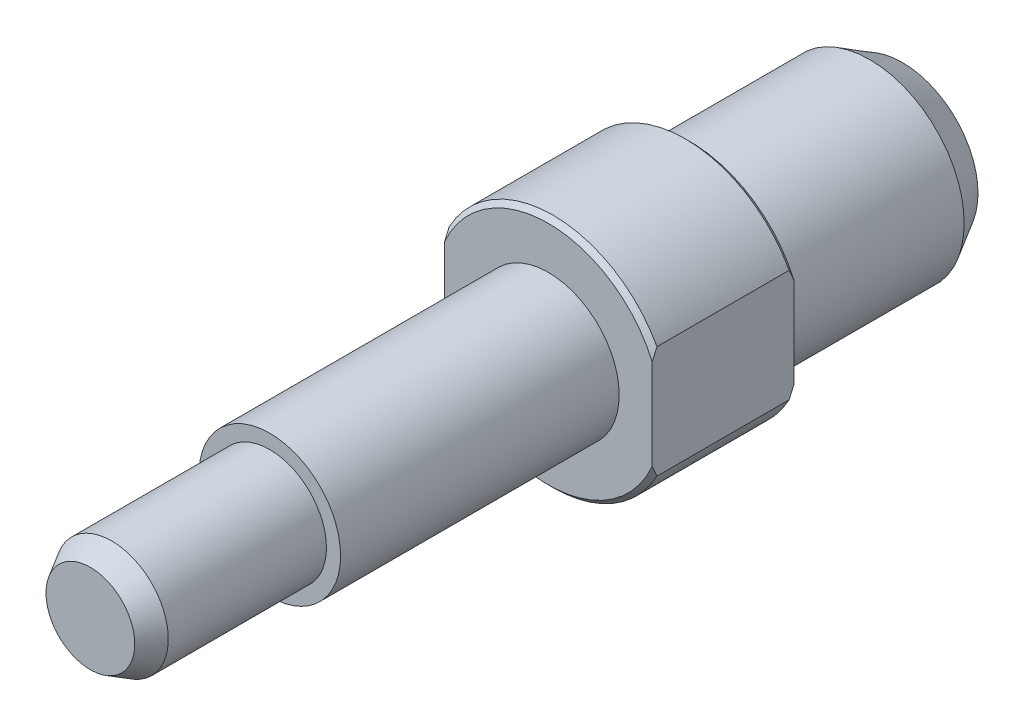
ISO-10303-21;
HEADER;
FILE_DESCRIPTION(('STEP AP214'),'2;1');
FILE_NAME('part.step','',(''),(''),'','','');
FILE_SCHEMA(('AUTOMOTIVE_DESIGN { 1 0 10303 214 1 1 1 1 }'));
ENDSEC;
DATA;
#1=APPLICATION_CONTEXT('core data for automotive mechanical design processes');
#2=APPLICATION_PROTOCOL_DEFINITION('international standard','automotive_design',2000,#1);
#3=PRODUCT_CONTEXT('',#1,'mechanical');
#4=PRODUCT('Part','Part','',(#3));
#5=PRODUCT_RELATED_PRODUCT_CATEGORY('part','',(#4));
#6=PRODUCT_DEFINITION_FORMATION('','',#4);
#7=PRODUCT_DEFINITION_CONTEXT('part definition',#1,'design');
#8=PRODUCT_DEFINITION('design','',#6,#7);
#9=PRODUCT_DEFINITION_SHAPE('','',#8);
#10=(LENGTH_UNIT() NAMED_UNIT(*) SI_UNIT(.MILLI.,.METRE.));
#11=(NAMED_UNIT(*) PLANE_ANGLE_UNIT() SI_UNIT($,.RADIAN.));
#12=(NAMED_UNIT(*) SI_UNIT($,.STERADIAN.) SOLID_ANGLE_UNIT());
#13=UNCERTAINTY_MEASURE_WITH_UNIT(LENGTH_MEASURE(1.E-05),#10,'distance_accuracy_value','');
#14=(GEOMETRIC_REPRESENTATION_CONTEXT(3) GLOBAL_UNCERTAINTY_ASSIGNED_CONTEXT((#13)) GLOBAL_UNIT_ASSIGNED_CONTEXT((#10,
#11,#12)) REPRESENTATION_CONTEXT('',''));
#15=CARTESIAN_POINT('',(0.,0.,0.));
#16=DIRECTION('',(0.,0.,1.));
#17=DIRECTION('',(1.,0.,0.));
#18=AXIS2_PLACEMENT_3D('',#15,#16,#17);
#19=CARTESIAN_POINT('',(0.,0.,0.));
#20=DIRECTION('',(0.,0.,1.));
#21=DIRECTION('',(1.,0.,0.));
#22=AXIS2_PLACEMENT_3D('',#19,#20,#21);
#23=PLANE('',#22);
#24=CARTESIAN_POINT('',(0.,0.,0.));
#25=DIRECTION('',(0.,0.,1.));
#26=DIRECTION('',(1.,0.,0.));
#27=AXIS2_PLACEMENT_3D('',#24,#25,#26);
#28=CIRCLE('',#27,10.);
#29=CARTESIAN_POINT('',(10.,0.,0.));
#30=VERTEX_POINT('',#29);
#31=EDGE_CURVE('E221',#30,#30,#28,.T.);
#32=ORIENTED_EDGE('',*,*,#31,.T.);
#33=EDGE_LOOP('',(#32));
#34=FACE_BOUND('',#33,.T.);
#35=DIRECTION('',(0.,-1.,0.));
#36=VECTOR('',#35,1.);
#37=CARTESIAN_POINT('',(11.,0.,0.));
#38=LINE('',#37,#36);
#39=CARTESIAN_POINT('',(11.,4.7958315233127,0.));
#40=VERTEX_POINT('',#39);
#41=CARTESIAN_POINT('',(11.,-4.7958315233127,0.));
#42=VERTEX_POINT('',#41);
#43=EDGE_CURVE('E212',#40,#42,#38,.T.);
#44=ORIENTED_EDGE('',*,*,#43,.T.);
#45=CARTESIAN_POINT('',(0.,0.,0.));
#46=DIRECTION('',(0.,0.,1.));
#47=DIRECTION('',(1.,0.,0.));
#48=AXIS2_PLACEMENT_3D('',#45,#46,#47);
#49=CIRCLE('',#48,12.);
#50=CARTESIAN_POINT('',(-11.,-4.7958315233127,0.));
#51=VERTEX_POINT('',#50);
#52=EDGE_CURVE('E398',#42,#51,#49,.F.);
#53=ORIENTED_EDGE('',*,*,#52,.T.);
#54=DIRECTION('',(0.,-1.,0.));
#55=VECTOR('',#54,1.);
#56=CARTESIAN_POINT('',(-11.,0.,0.));
#57=LINE('',#56,#55);
#58=CARTESIAN_POINT('',(-11.,4.7958315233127,0.));
#59=VERTEX_POINT('',#58);
#60=EDGE_CURVE('E87',#59,#51,#57,.T.);
#61=ORIENTED_EDGE('',*,*,#60,.F.);
#62=CARTESIAN_POINT('',(0.,0.,0.));
#63=DIRECTION('',(0.,0.,1.));
#64=DIRECTION('',(1.,0.,0.));
#65=AXIS2_PLACEMENT_3D('',#62,#63,#64);
#66=CIRCLE('',#65,12.);
#67=EDGE_CURVE('E397',#59,#40,#66,.F.);
#68=ORIENTED_EDGE('',*,*,#67,.T.);
#69=EDGE_LOOP('',(#44,#53,#61,#68));
#70=FACE_BOUND('',#69,.T.);
#71=ADVANCED_FACE('F14',(#34,#70),#23,.F.);
#72=CARTESIAN_POINT('',(0.,0.,15.));
#73=DIRECTION('',(0.,0.,-1.));
#74=DIRECTION('',(-1.,0.,0.));
#75=AXIS2_PLACEMENT_3D('',#72,#73,#74);
#76=CYLINDRICAL_SURFACE('',#75,12.5);
#77=DIRECTION('',(0.,0.,1.));
#78=VECTOR('',#77,1.);
#79=CARTESIAN_POINT('',(11.,5.93717104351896,-22.5));
#80=LINE('',#79,#78);
#81=CARTESIAN_POINT('',(11.,5.93717104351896,0.500000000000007));
#82=VERTEX_POINT('',#81);
#83=CARTESIAN_POINT('',(11.,5.93717104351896,14.5));
#84=VERTEX_POINT('',#83);
#85=EDGE_CURVE('E186',#82,#84,#80,.T.);
#86=ORIENTED_EDGE('',*,*,#85,.F.);
#87=CARTESIAN_POINT('',(0.,0.,0.500000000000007));
#88=DIRECTION('',(0.,0.,1.));
#89=DIRECTION('',(1.,0.,0.));
#90=AXIS2_PLACEMENT_3D('',#87,#88,#89);
#91=CIRCLE('',#90,12.5);
#92=CARTESIAN_POINT('',(-11.,5.93717104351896,0.500000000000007));
#93=VERTEX_POINT('',#92);
#94=EDGE_CURVE('E9',#82,#93,#91,.T.);
#95=ORIENTED_EDGE('',*,*,#94,.T.);
#96=DIRECTION('',(0.,0.,1.));
#97=VECTOR('',#96,1.);
#98=CARTESIAN_POINT('',(-11.,5.93717104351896,-22.5));
#99=LINE('',#98,#97);
#100=CARTESIAN_POINT('',(-11.,5.93717104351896,14.5));
#101=VERTEX_POINT('',#100);
#102=EDGE_CURVE('E102',#93,#101,#99,.T.);
#103=ORIENTED_EDGE('',*,*,#102,.T.);
#104=CARTESIAN_POINT('',(0.,0.,14.5));
#105=DIRECTION('',(0.,0.,1.));
#106=DIRECTION('',(1.,0.,0.));
#107=AXIS2_PLACEMENT_3D('',#104,#105,#106);
#108=CIRCLE('',#107,12.5);
#109=EDGE_CURVE('E23',#101,#84,#108,.F.);
#110=ORIENTED_EDGE('',*,*,#109,.T.);
#111=EDGE_LOOP('',(#86,#95,#103,#110));
#112=FACE_BOUND('',#111,.T.);
#113=ADVANCED_FACE('F185',(#112),#76,.T.);
#114=DIRECTION('',(0.,0.,1.));
#115=VECTOR('',#114,1.);
#116=CARTESIAN_POINT('',(-11.,-5.93717104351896,-22.5));
#117=LINE('',#116,#115);
#118=CARTESIAN_POINT('',(-11.,-5.93717104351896,0.500000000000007));
#119=VERTEX_POINT('',#118);
#120=CARTESIAN_POINT('',(-11.,-5.93717104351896,14.5));
#121=VERTEX_POINT('',#120);
#122=EDGE_CURVE('E84',#119,#121,#117,.T.);
#123=ORIENTED_EDGE('',*,*,#122,.F.);
#124=CARTESIAN_POINT('',(0.,0.,0.500000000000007));
#125=DIRECTION('',(0.,0.,1.));
#126=DIRECTION('',(1.,0.,0.));
#127=AXIS2_PLACEMENT_3D('',#124,#125,#126);
#128=CIRCLE('',#127,12.5);
#129=CARTESIAN_POINT('',(11.,-5.93717104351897,0.500000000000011));
#130=VERTEX_POINT('',#129);
#131=EDGE_CURVE('E98',#119,#130,#128,.T.);
#132=ORIENTED_EDGE('',*,*,#131,.T.);
#133=DIRECTION('',(0.,0.,1.));
#134=VECTOR('',#133,1.);
#135=CARTESIAN_POINT('',(11.,-5.93717104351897,-22.5));
#136=LINE('',#135,#134);
#137=CARTESIAN_POINT('',(11.,-5.93717104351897,14.5));
#138=VERTEX_POINT('',#137);
#139=EDGE_CURVE('E193',#130,#138,#136,.T.);
#140=ORIENTED_EDGE('',*,*,#139,.T.);
#141=CARTESIAN_POINT('',(0.,0.,14.5));
#142=DIRECTION('',(0.,0.,1.));
#143=DIRECTION('',(1.,0.,0.));
#144=AXIS2_PLACEMENT_3D('',#141,#142,#143);
#145=CIRCLE('',#144,12.5);
#146=EDGE_CURVE('E101',#138,#121,#145,.F.);
#147=ORIENTED_EDGE('',*,*,#146,.T.);
#148=EDGE_LOOP('',(#123,#132,#140,#147));
#149=FACE_BOUND('',#148,.T.);
#150=ADVANCED_FACE('F96',(#149),#76,.T.);
#151=CARTESIAN_POINT('',(0.,0.,15.));
#152=DIRECTION('',(0.,0.,1.));
#153=DIRECTION('',(1.,0.,0.));
#154=AXIS2_PLACEMENT_3D('',#151,#152,#153);
#155=PLANE('',#154);
#156=CARTESIAN_POINT('',(0.,0.,15.));
#157=DIRECTION('',(0.,0.,1.));
#158=DIRECTION('',(1.,0.,0.));
#159=AXIS2_PLACEMENT_3D('',#156,#157,#158);
#160=CIRCLE('',#159,7.5);
#161=CARTESIAN_POINT('',(7.5,0.,15.));
#162=VERTEX_POINT('',#161);
#163=EDGE_CURVE('E218',#162,#162,#160,.T.);
#164=ORIENTED_EDGE('',*,*,#163,.F.);
#165=EDGE_LOOP('',(#164));
#166=FACE_BOUND('',#165,.T.);
#167=DIRECTION('',(0.,-1.,0.));
#168=VECTOR('',#167,1.);
#169=CARTESIAN_POINT('',(-11.,5.93717104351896,15.));
#170=LINE('',#169,#168);
#171=CARTESIAN_POINT('',(-11.,4.79583152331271,15.));
#172=VERTEX_POINT('',#171);
#173=CARTESIAN_POINT('',(-11.,-4.79583152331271,15.));
#174=VERTEX_POINT('',#173);
#175=EDGE_CURVE('E103',#172,#174,#170,.T.);
#176=ORIENTED_EDGE('',*,*,#175,.T.);
#177=CARTESIAN_POINT('',(0.,0.,15.));
#178=DIRECTION('',(0.,0.,1.));
#179=DIRECTION('',(1.,0.,0.));
#180=AXIS2_PLACEMENT_3D('',#177,#178,#179);
#181=CIRCLE('',#180,12.);
#182=CARTESIAN_POINT('',(11.,-4.79583152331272,15.));
#183=VERTEX_POINT('',#182);
#184=EDGE_CURVE('E179',#174,#183,#181,.T.);
#185=ORIENTED_EDGE('',*,*,#184,.T.);
#186=DIRECTION('',(0.,-1.,0.));
#187=VECTOR('',#186,1.);
#188=CARTESIAN_POINT('',(11.,5.93717104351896,15.));
#189=LINE('',#188,#187);
#190=CARTESIAN_POINT('',(11.,4.79583152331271,15.));
#191=VERTEX_POINT('',#190);
#192=EDGE_CURVE('E194',#191,#183,#189,.T.);
#193=ORIENTED_EDGE('',*,*,#192,.F.);
#194=CARTESIAN_POINT('',(0.,0.,15.));
#195=DIRECTION('',(0.,0.,1.));
#196=DIRECTION('',(1.,0.,0.));
#197=AXIS2_PLACEMENT_3D('',#194,#195,#196);
#198=CIRCLE('',#197,12.);
#199=EDGE_CURVE('E91',#191,#172,#198,.T.);
#200=ORIENTED_EDGE('',*,*,#199,.T.);
#201=EDGE_LOOP('',(#176,#185,#193,#200));
#202=FACE_BOUND('',#201,.T.);
#203=ADVANCED_FACE('F199',(#166,#202),#155,.T.);
#204=CARTESIAN_POINT('',(0.,0.,0.));
#205=DIRECTION('',(0.,0.,-1.));
#206=DIRECTION('',(-1.,0.,0.));
#207=AXIS2_PLACEMENT_3D('',#204,#205,#206);
#208=CYLINDRICAL_SURFACE('',#207,10.);
#209=CARTESIAN_POINT('',(0.,0.,-19.0358983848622));
#210=DIRECTION('',(0.,0.,1.));
#211=DIRECTION('',(1.,0.,0.));
#212=AXIS2_PLACEMENT_3D('',#209,#210,#211);
#213=CIRCLE('',#212,10.);
#214=CARTESIAN_POINT('',(10.,0.,-19.0358983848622));
#215=VERTEX_POINT('',#214);
#216=EDGE_CURVE('E201',#215,#215,#213,.T.);
#217=ORIENTED_EDGE('',*,*,#216,.T.);
#218=EDGE_LOOP('',(#217));
#219=FACE_BOUND('',#218,.T.);
#220=ORIENTED_EDGE('',*,*,#31,.F.);
#221=EDGE_LOOP('',(#220));
#222=FACE_BOUND('',#221,.T.);
#223=ADVANCED_FACE('F228',(#219,#222),#208,.T.);
#224=CARTESIAN_POINT('',(0.,0.,44.5));
#225=DIRECTION('',(0.,0.,-1.));
#226=DIRECTION('',(-1.,0.,0.));
#227=AXIS2_PLACEMENT_3D('',#224,#225,#226);
#228=CYLINDRICAL_SURFACE('',#227,7.5);
#229=CARTESIAN_POINT('',(0.,0.,44.5));
#230=DIRECTION('',(0.,0.,1.));
#231=DIRECTION('',(1.,0.,0.));
#232=AXIS2_PLACEMENT_3D('',#229,#230,#231);
#233=CIRCLE('',#232,7.5);
#234=CARTESIAN_POINT('',(7.5,0.,44.5));
#235=VERTEX_POINT('',#234);
#236=EDGE_CURVE('E215',#235,#235,#233,.T.);
#237=ORIENTED_EDGE('',*,*,#236,.F.);
#238=EDGE_LOOP('',(#237));
#239=FACE_BOUND('',#238,.T.);
#240=ORIENTED_EDGE('',*,*,#163,.T.);
#241=EDGE_LOOP('',(#240));
#242=FACE_BOUND('',#241,.T.);
#243=ADVANCED_FACE('F230',(#239,#242),#228,.T.);
#244=CARTESIAN_POINT('',(0.,0.,44.5));
#245=DIRECTION('',(0.,0.,1.));
#246=DIRECTION('',(1.,0.,0.));
#247=AXIS2_PLACEMENT_3D('',#244,#245,#246);
#248=PLANE('',#247);
#249=CARTESIAN_POINT('',(0.,0.,44.5));
#250=DIRECTION('',(0.,0.,1.));
#251=DIRECTION('',(1.,0.,0.));
#252=AXIS2_PLACEMENT_3D('',#249,#250,#251);
#253=CIRCLE('',#252,6.);
#254=CARTESIAN_POINT('',(6.,0.,44.5));
#255=VERTEX_POINT('',#254);
#256=EDGE_CURVE('E111',#255,#255,#253,.T.);
#257=ORIENTED_EDGE('',*,*,#256,.F.);
#258=EDGE_LOOP('',(#257));
#259=FACE_BOUND('',#258,.T.);
#260=ORIENTED_EDGE('',*,*,#236,.T.);
#261=EDGE_LOOP('',(#260));
#262=FACE_BOUND('',#261,.T.);
#263=ADVANCED_FACE('F232',(#259,#262),#248,.T.);
#264=CARTESIAN_POINT('',(0.,0.,63.5));
#265=DIRECTION('',(0.,0.,-1.));
#266=DIRECTION('',(-1.,0.,0.));
#267=AXIS2_PLACEMENT_3D('',#264,#265,#266);
#268=CYLINDRICAL_SURFACE('',#267,6.);
#269=CARTESIAN_POINT('',(0.,0.,61.2483339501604));
#270=DIRECTION('',(0.,0.,-1.));
#271=DIRECTION('',(-1.,0.,0.));
#272=AXIS2_PLACEMENT_3D('',#269,#270,#271);
#273=CIRCLE('',#272,6.);
#274=CARTESIAN_POINT('',(-6.,0.,61.2483339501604));
#275=VERTEX_POINT('',#274);
#276=EDGE_CURVE('E269',#275,#275,#273,.T.);
#277=ORIENTED_EDGE('',*,*,#276,.T.);
#278=EDGE_LOOP('',(#277));
#279=FACE_BOUND('',#278,.T.);
#280=ORIENTED_EDGE('',*,*,#256,.T.);
#281=EDGE_LOOP('',(#280));
#282=FACE_BOUND('',#281,.T.);
#283=ADVANCED_FACE('F130',(#279,#282),#268,.T.);
#284=CARTESIAN_POINT('',(11.,5.93717104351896,-22.5));
#285=DIRECTION('',(-1.,0.,0.));
#286=DIRECTION('',(0.,-1.,0.));
#287=AXIS2_PLACEMENT_3D('',#284,#285,#286);
#288=PLANE('',#287);
#289=ORIENTED_EDGE('',*,*,#139,.F.);
#290=CARTESIAN_POINT('',(11.,-5.93717104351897,0.500000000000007));
#291=CARTESIAN_POINT('',(11.,-5.84334950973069,0.455437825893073));
#292=CARTESIAN_POINT('',(11.,-5.74921029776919,0.41154159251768));
#293=CARTESIAN_POINT('',(11.,-5.56030813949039,0.325176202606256));
#294=CARTESIAN_POINT('',(11.,-5.4655453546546,0.282706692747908));
#295=CARTESIAN_POINT('',(11.,-5.27535928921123,0.199266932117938));
#296=CARTESIAN_POINT('',(11.,-5.17993599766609,0.158296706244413));
#297=CARTESIAN_POINT('',(11.,-4.98839837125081,0.077936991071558));
#298=CARTESIAN_POINT('',(11.,-4.89228386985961,0.0385478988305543));
#299=CARTESIAN_POINT('',(11.,-4.7958315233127,0.));
#300=B_SPLINE_CURVE_WITH_KNOTS('',3,(#290,#291,#292,#293,#294,#295,#296,#297,#298,#299),
.UNSPECIFIED.,.F.,.F.,(4,2,2,2,4),(0.,0.311598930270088,0.623120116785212,0.934646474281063,
1.24625057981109),.UNSPECIFIED.);
#301=EDGE_CURVE('E106',#130,#42,#300,.T.);
#302=ORIENTED_EDGE('',*,*,#301,.T.);
#303=ORIENTED_EDGE('',*,*,#43,.F.);
#304=CARTESIAN_POINT('',(11.,4.7958315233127,0.));
#305=CARTESIAN_POINT('',(11.,4.89228386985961,0.0385478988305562));
#306=CARTESIAN_POINT('',(11.,4.9883983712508,0.0779369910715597));
#307=CARTESIAN_POINT('',(11.,5.17993599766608,0.158296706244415));
#308=CARTESIAN_POINT('',(11.,5.27535928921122,0.19926693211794));
#309=CARTESIAN_POINT('',(11.,5.4655453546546,0.282706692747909));
#310=CARTESIAN_POINT('',(11.,5.56030813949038,0.325176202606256));
#311=CARTESIAN_POINT('',(11.,5.74921029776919,0.411541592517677));
#312=CARTESIAN_POINT('',(11.,5.84334950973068,0.455437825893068));
#313=CARTESIAN_POINT('',(11.,5.93717104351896,0.5));
#314=B_SPLINE_CURVE_WITH_KNOTS('',3,(#304,#305,#306,#307,#308,#309,#310,#311,#312,#313),
.UNSPECIFIED.,.F.,.F.,(4,2,2,2,4),(0.,0.31160410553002,0.623130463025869,0.93465164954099,
1.24625057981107),.UNSPECIFIED.);
#315=EDGE_CURVE('E109',#40,#82,#314,.T.);
#316=ORIENTED_EDGE('',*,*,#315,.T.);
#317=ORIENTED_EDGE('',*,*,#85,.T.);
#318=CARTESIAN_POINT('',(11.,5.93717104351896,14.5));
#319=CARTESIAN_POINT('',(11.,5.84334950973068,14.5445621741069));
#320=CARTESIAN_POINT('',(11.,5.74921029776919,14.5884584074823));
#321=CARTESIAN_POINT('',(11.,5.56030813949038,14.6748237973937));
#322=CARTESIAN_POINT('',(11.,5.4655453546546,14.7172933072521));
#323=CARTESIAN_POINT('',(11.,5.27535928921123,14.8007330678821));
#324=CARTESIAN_POINT('',(11.,5.17993599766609,14.8417032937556));
#325=CARTESIAN_POINT('',(11.,4.98839837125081,14.9220630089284));
#326=CARTESIAN_POINT('',(11.,4.89228386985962,14.9614521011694));
#327=CARTESIAN_POINT('',(11.,4.79583152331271,15.));
#328=B_SPLINE_CURVE_WITH_KNOTS('',3,(#318,#319,#320,#321,#322,#323,#324,#325,#326,#327),
.UNSPECIFIED.,.F.,.F.,(4,2,2,2,4),(0.,0.311598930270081,0.6231201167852,0.934646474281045,
1.24625057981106),.UNSPECIFIED.);
#329=EDGE_CURVE('E107',#84,#191,#328,.T.);
#330=ORIENTED_EDGE('',*,*,#329,.T.);
#331=ORIENTED_EDGE('',*,*,#192,.T.);
#332=CARTESIAN_POINT('',(11.,-4.79583152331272,15.));
#333=CARTESIAN_POINT('',(11.,-4.89228386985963,14.9614521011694));
#334=CARTESIAN_POINT('',(11.,-4.98839837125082,14.9220630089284));
#335=CARTESIAN_POINT('',(11.,-5.1799359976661,14.8417032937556));
#336=CARTESIAN_POINT('',(11.,-5.27535928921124,14.8007330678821));
#337=CARTESIAN_POINT('',(11.,-5.46554535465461,14.7172933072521));
#338=CARTESIAN_POINT('',(11.,-5.56030813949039,14.6748237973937));
#339=CARTESIAN_POINT('',(11.,-5.7492102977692,14.5884584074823));
#340=CARTESIAN_POINT('',(11.,-5.84334950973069,14.5445621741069));
#341=CARTESIAN_POINT('',(11.,-5.93717104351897,14.5));
#342=B_SPLINE_CURVE_WITH_KNOTS('',3,(#332,#333,#334,#335,#336,#337,#338,#339,#340,#341),
.UNSPECIFIED.,.F.,.F.,(4,2,2,2,4),(0.,0.311604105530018,0.623130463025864,0.934651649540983,
1.24625057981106),.UNSPECIFIED.);
#343=EDGE_CURVE('E140',#183,#138,#342,.T.);
#344=ORIENTED_EDGE('',*,*,#343,.T.);
#345=EDGE_LOOP('',(#289,#302,#303,#316,#317,#330,#331,#344));
#346=FACE_BOUND('',#345,.T.);
#347=ADVANCED_FACE('F125',(#346),#288,.F.);
#348=CARTESIAN_POINT('',(-11.,5.93717104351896,-22.5));
#349=DIRECTION('',(-1.,0.,0.));
#350=DIRECTION('',(0.,0.,1.));
#351=AXIS2_PLACEMENT_3D('',#348,#349,#350);
#352=PLANE('',#351);
#353=ORIENTED_EDGE('',*,*,#60,.T.);
#354=CARTESIAN_POINT('',(-11.,-4.7958315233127,0.));
#355=CARTESIAN_POINT('',(-11.,-4.89228386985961,0.0385478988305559));
#356=CARTESIAN_POINT('',(-11.,-4.9883983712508,0.0779369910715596));
#357=CARTESIAN_POINT('',(-11.,-5.17993599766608,0.158296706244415));
#358=CARTESIAN_POINT('',(-11.,-5.27535928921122,0.19926693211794));
#359=CARTESIAN_POINT('',(-11.,-5.4655453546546,0.282706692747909));
#360=CARTESIAN_POINT('',(-11.,-5.56030813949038,0.325176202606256));
#361=CARTESIAN_POINT('',(-11.,-5.74921029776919,0.411541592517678));
#362=CARTESIAN_POINT('',(-11.,-5.84334950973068,0.455437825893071));
#363=CARTESIAN_POINT('',(-11.,-5.93717104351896,0.500000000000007));
#364=B_SPLINE_CURVE_WITH_KNOTS('',3,(#354,#355,#356,#357,#358,#359,#360,#361,#362,#363),
.UNSPECIFIED.,.F.,.F.,(4,2,2,2,4),(0.,0.311604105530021,0.62313046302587,0.934651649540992,
1.24625057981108),.UNSPECIFIED.);
#365=EDGE_CURVE('E81',#51,#119,#364,.T.);
#366=ORIENTED_EDGE('',*,*,#365,.T.);
#367=ORIENTED_EDGE('',*,*,#122,.T.);
#368=CARTESIAN_POINT('',(-11.,-5.93717104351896,14.5));
#369=CARTESIAN_POINT('',(-11.,-5.84334950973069,14.5445621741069));
#370=CARTESIAN_POINT('',(-11.,-5.74921029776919,14.5884584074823));
#371=CARTESIAN_POINT('',(-11.,-5.56030813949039,14.6748237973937));
#372=CARTESIAN_POINT('',(-11.,-5.4655453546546,14.7172933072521));
#373=CARTESIAN_POINT('',(-11.,-5.27535928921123,14.8007330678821));
#374=CARTESIAN_POINT('',(-11.,-5.1799359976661,14.8417032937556));
#375=CARTESIAN_POINT('',(-11.,-4.98839837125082,14.9220630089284));
#376=CARTESIAN_POINT('',(-11.,-4.89228386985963,14.9614521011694));
#377=CARTESIAN_POINT('',(-11.,-4.79583152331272,15.));
#378=B_SPLINE_CURVE_WITH_KNOTS('',3,(#368,#369,#370,#371,#372,#373,#374,#375,#376,#377),
.UNSPECIFIED.,.F.,.F.,(4,2,2,2,4),(0.,0.31159893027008,0.623120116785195,0.934646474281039,
1.24625057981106),.UNSPECIFIED.);
#379=EDGE_CURVE('E92',#121,#174,#378,.T.);
#380=ORIENTED_EDGE('',*,*,#379,.T.);
#381=ORIENTED_EDGE('',*,*,#175,.F.);
#382=CARTESIAN_POINT('',(-11.,4.79583152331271,15.));
#383=CARTESIAN_POINT('',(-11.,4.89228386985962,14.9614521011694));
#384=CARTESIAN_POINT('',(-11.,4.98839837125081,14.9220630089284));
#385=CARTESIAN_POINT('',(-11.,5.17993599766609,14.8417032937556));
#386=CARTESIAN_POINT('',(-11.,5.27535928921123,14.8007330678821));
#387=CARTESIAN_POINT('',(-11.,5.4655453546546,14.7172933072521));
#388=CARTESIAN_POINT('',(-11.,5.56030813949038,14.6748237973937));
#389=CARTESIAN_POINT('',(-11.,5.74921029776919,14.5884584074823));
#390=CARTESIAN_POINT('',(-11.,5.84334950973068,14.5445621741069));
#391=CARTESIAN_POINT('',(-11.,5.93717104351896,14.5));
#392=B_SPLINE_CURVE_WITH_KNOTS('',3,(#382,#383,#384,#385,#386,#387,#388,#389,#390,#391),
.UNSPECIFIED.,.F.,.F.,(4,2,2,2,4),(0.,0.311604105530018,0.623130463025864,0.934651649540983,
1.24625057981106),.UNSPECIFIED.);
#393=EDGE_CURVE('E30',#172,#101,#392,.T.);
#394=ORIENTED_EDGE('',*,*,#393,.T.);
#395=ORIENTED_EDGE('',*,*,#102,.F.);
#396=CARTESIAN_POINT('',(-11.,5.93717104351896,0.500000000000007));
#397=CARTESIAN_POINT('',(-11.,5.84334950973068,0.455437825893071));
#398=CARTESIAN_POINT('',(-11.,5.74921029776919,0.411541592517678));
#399=CARTESIAN_POINT('',(-11.,5.56030813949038,0.325176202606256));
#400=CARTESIAN_POINT('',(-11.,5.4655453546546,0.282706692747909));
#401=CARTESIAN_POINT('',(-11.,5.27535928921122,0.19926693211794));
#402=CARTESIAN_POINT('',(-11.,5.17993599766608,0.158296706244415));
#403=CARTESIAN_POINT('',(-11.,4.9883983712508,0.0779369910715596));
#404=CARTESIAN_POINT('',(-11.,4.89228386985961,0.0385478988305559));
#405=CARTESIAN_POINT('',(-11.,4.7958315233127,0.));
#406=B_SPLINE_CURVE_WITH_KNOTS('',3,(#396,#397,#398,#399,#400,#401,#402,#403,#404,#405),
.UNSPECIFIED.,.F.,.F.,(4,2,2,2,4),(0.,0.311598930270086,0.623120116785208,0.934646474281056,
1.24625057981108),.UNSPECIFIED.);
#407=EDGE_CURVE('E38',#93,#59,#406,.T.);
#408=ORIENTED_EDGE('',*,*,#407,.T.);
#409=EDGE_LOOP('',(#353,#366,#367,#380,#381,#394,#395,#408));
#410=FACE_BOUND('',#409,.T.);
#411=ADVANCED_FACE('F83',(#410),#352,.T.);
#412=CARTESIAN_POINT('',(0.,0.,0.500000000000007));
#413=DIRECTION('',(0.,0.,1.));
#414=DIRECTION('',(1.,0.,0.));
#415=AXIS2_PLACEMENT_3D('',#412,#413,#414);
#416=CONICAL_SURFACE('',#415,12.5,0.78539816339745);
#417=ORIENTED_EDGE('',*,*,#365,.F.);
#418=ORIENTED_EDGE('',*,*,#52,.F.);
#419=ORIENTED_EDGE('',*,*,#301,.F.);
#420=ORIENTED_EDGE('',*,*,#131,.F.);
#421=EDGE_LOOP('',(#417,#418,#419,#420));
#422=FACE_BOUND('',#421,.T.);
#423=ADVANCED_FACE('F105',(#422),#416,.T.);
#424=CARTESIAN_POINT('',(0.,0.,15.));
#425=DIRECTION('',(0.,0.,-1.));
#426=DIRECTION('',(-1.,0.,0.));
#427=AXIS2_PLACEMENT_3D('',#424,#425,#426);
#428=CONICAL_SURFACE('',#427,12.,0.785398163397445);
#429=ORIENTED_EDGE('',*,*,#379,.F.);
#430=ORIENTED_EDGE('',*,*,#146,.F.);
#431=ORIENTED_EDGE('',*,*,#343,.F.);
#432=ORIENTED_EDGE('',*,*,#184,.F.);
#433=EDGE_LOOP('',(#429,#430,#431,#432));
#434=FACE_BOUND('',#433,.T.);
#435=ADVANCED_FACE('F152',(#434),#428,.T.);
#436=CARTESIAN_POINT('',(0.,0.,0.500000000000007));
#437=DIRECTION('',(0.,0.,1.));
#438=DIRECTION('',(1.,0.,0.));
#439=AXIS2_PLACEMENT_3D('',#436,#437,#438);
#440=CONICAL_SURFACE('',#439,12.5,0.78539816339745);
#441=ORIENTED_EDGE('',*,*,#315,.F.);
#442=ORIENTED_EDGE('',*,*,#67,.F.);
#443=ORIENTED_EDGE('',*,*,#407,.F.);
#444=ORIENTED_EDGE('',*,*,#94,.F.);
#445=EDGE_LOOP('',(#441,#442,#443,#444));
#446=FACE_BOUND('',#445,.T.);
#447=ADVANCED_FACE('F155',(#446),#440,.T.);
#448=CARTESIAN_POINT('',(0.,0.,15.));
#449=DIRECTION('',(0.,0.,-1.));
#450=DIRECTION('',(-1.,0.,0.));
#451=AXIS2_PLACEMENT_3D('',#448,#449,#450);
#452=CONICAL_SURFACE('',#451,12.,0.785398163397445);
#453=ORIENTED_EDGE('',*,*,#329,.F.);
#454=ORIENTED_EDGE('',*,*,#109,.F.);
#455=ORIENTED_EDGE('',*,*,#393,.F.);
#456=ORIENTED_EDGE('',*,*,#199,.F.);
#457=EDGE_LOOP('',(#453,#454,#455,#456));
#458=FACE_BOUND('',#457,.T.);
#459=ADVANCED_FACE('F16',(#458),#452,.T.);
#460=CARTESIAN_POINT('',(0.,0.,-13.383487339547));
#461=DIRECTION('',(0.,0.,1.));
#462=DIRECTION('',(1.,0.,0.));
#463=AXIS2_PLACEMENT_3D('',#460,#461,#462);
#464=CONICAL_SURFACE('',#463,13.2634210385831,0.523598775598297);
#465=CARTESIAN_POINT('',(0.,0.,-22.5));
#466=DIRECTION('',(0.,0.,-1.));
#467=DIRECTION('',(-1.,0.,0.));
#468=AXIS2_PLACEMENT_3D('',#465,#466,#467);
#469=CIRCLE('',#468,8.);
#470=CARTESIAN_POINT('',(-8.,0.,-22.5));
#471=VERTEX_POINT('',#470);
#472=EDGE_CURVE('E204',#471,#471,#469,.T.);
#473=ORIENTED_EDGE('',*,*,#472,.F.);
#474=EDGE_LOOP('',(#473));
#475=FACE_BOUND('',#474,.T.);
#476=ORIENTED_EDGE('',*,*,#216,.F.);
#477=EDGE_LOOP('',(#476));
#478=FACE_BOUND('',#477,.T.);
#479=ADVANCED_FACE('F257',(#475,#478),#464,.T.);
#480=CARTESIAN_POINT('',(0.,0.,-22.5));
#481=DIRECTION('',(0.,0.,1.));
#482=DIRECTION('',(1.,0.,0.));
#483=AXIS2_PLACEMENT_3D('',#480,#481,#482);
#484=PLANE('',#483);
#485=ORIENTED_EDGE('',*,*,#472,.T.);
#486=EDGE_LOOP('',(#485));
#487=FACE_BOUND('',#486,.T.);
#488=ADVANCED_FACE('F254',(#487),#484,.F.);
#489=CARTESIAN_POINT('',(0.,0.,63.5));
#490=DIRECTION('',(0.,0.,-1.));
#491=DIRECTION('',(-1.,0.,0.));
#492=AXIS2_PLACEMENT_3D('',#489,#490,#491);
#493=CONICAL_SURFACE('',#492,4.7,0.523598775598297);
#494=CARTESIAN_POINT('',(0.,0.,63.5));
#495=DIRECTION('',(0.,0.,-1.));
#496=DIRECTION('',(-1.,0.,0.));
#497=AXIS2_PLACEMENT_3D('',#494,#495,#496);
#498=CIRCLE('',#497,4.7);
#499=CARTESIAN_POINT('',(-4.7,0.,63.5));
#500=VERTEX_POINT('',#499);
#501=EDGE_CURVE('E271',#500,#500,#498,.T.);
#502=ORIENTED_EDGE('',*,*,#501,.T.);
#503=EDGE_LOOP('',(#502));
#504=FACE_BOUND('',#503,.T.);
#505=ORIENTED_EDGE('',*,*,#276,.F.);
#506=EDGE_LOOP('',(#505));
#507=FACE_BOUND('',#506,.T.);
#508=ADVANCED_FACE('F256',(#504,#507),#493,.T.);
#509=CARTESIAN_POINT('',(0.,0.,63.5));
#510=DIRECTION('',(0.,0.,1.));
#511=DIRECTION('',(1.,0.,0.));
#512=AXIS2_PLACEMENT_3D('',#509,#510,#511);
#513=PLANE('',#512);
#514=ORIENTED_EDGE('',*,*,#501,.F.);
#515=EDGE_LOOP('',(#514));
#516=FACE_BOUND('',#515,.T.);
#517=ADVANCED_FACE('F134',(#516),#513,.T.);
#518=CLOSED_SHELL('',(#71,#113,#150,#203,#223,#243,#263,#283,#347,#411,#423,#435,#447,#459,#479,
#488,#508,#517));
#519=MANIFOLD_SOLID_BREP('B1',#518);
#520=ADVANCED_BREP_SHAPE_REPRESENTATION('',(#18,#519),#14);
#521=SHAPE_DEFINITION_REPRESENTATION(#9,#520);
ENDSEC;
END-ISO-10303-21;
